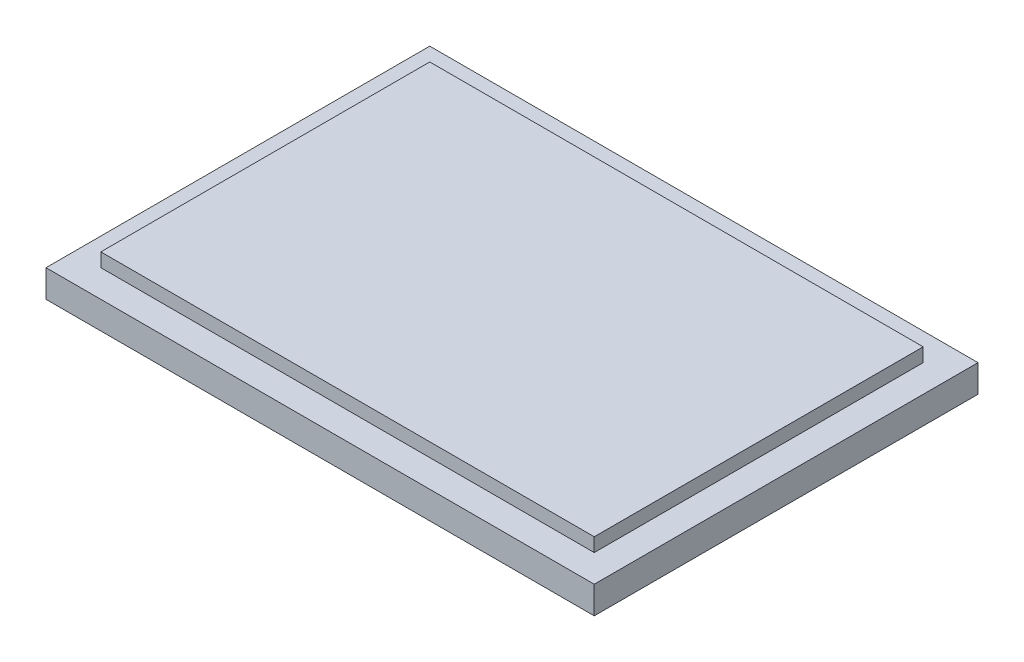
from build123d import *

# Parameters (mm, degrees)
SKETCH1_W           = 127
SKETCH1_H           = 88.9
BOSS_EXTRUDE1_DEPTH = 6.35
SKETCH2_W           = 114.3
SKETCH2_H           = 76.2
BOSS_EXTRUDE2_DEPTH = 3.175


with BuildPart() as part:
    # Sketch1 → Boss-Extrude1 (new body)
    with BuildSketch(Plane(origin=(0, 0, 0), x_dir=(1, 0, 0), z_dir=(0, 1, 0))):
        with Locations((22.181728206, -19.194786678)):
            Rectangle(SKETCH1_W, SKETCH1_H)
    extrude(amount=BOSS_EXTRUDE1_DEPTH)

    # Sketch2 → Boss-Extrude2 (add)
    with BuildSketch(Plane(origin=(0, 6.35, 0), x_dir=(1, 0, 0), z_dir=(0, 1, 0))):
        with Locations((22.181728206, -19.194786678)):
            Rectangle(SKETCH2_W, SKETCH2_H)
    extrude(amount=BOSS_EXTRUDE2_DEPTH)


solid = part.part
